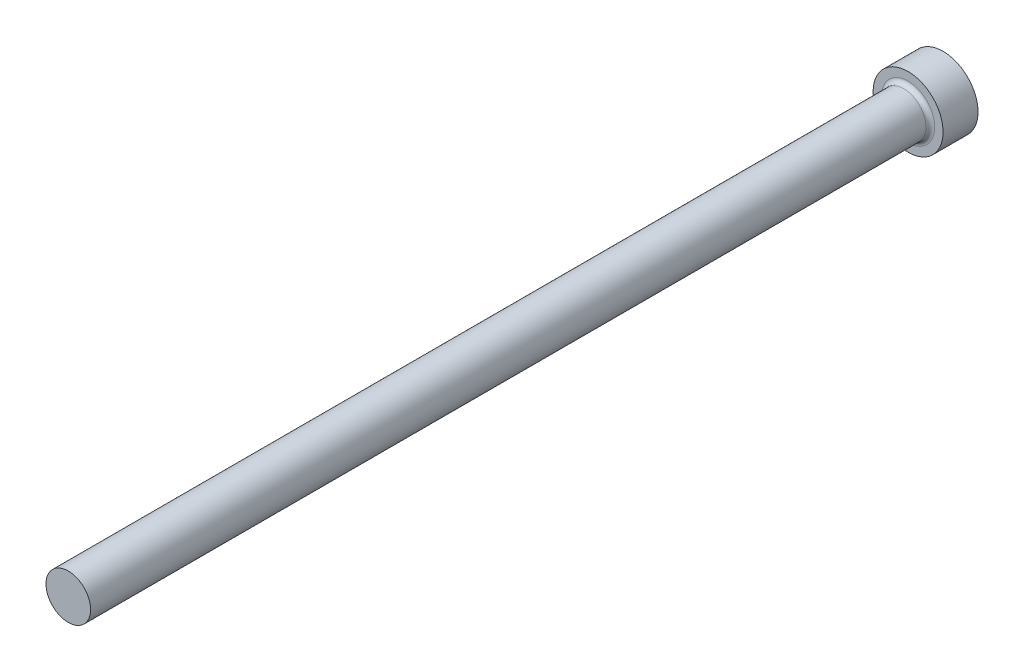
from build123d import *

# Parameters (mm, degrees)
FILLET1_R = 0.5


with BuildPart() as part:
    # FV → Revolve1 (revolve)
    with BuildSketch(Plane(origin=(0, 0, 0), x_dir=(1, 0, 0), z_dir=(0, 1, 0)), mode=Mode.PRIVATE) as revolve1_sk:
        Polygon((0, 0), (4, 0), (4, -4), (2.55, -4), (2.55, -100), (0, -100), align=None)
    revolve(revolve1_sk.sketch.rotate(Axis((0, 0, -9.033228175), (0, 0, 1)), 180), axis=Axis((0, 0, -9.033228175), (0, 0, 1)))

    # Fillet1
    fillet1_edges = [part.edges().sort_by_distance(p)[0] for p in [
        (2.55, 0, 4),
    ]]
    fillet(fillet1_edges, radius=FILLET1_R)


solid = part.part
